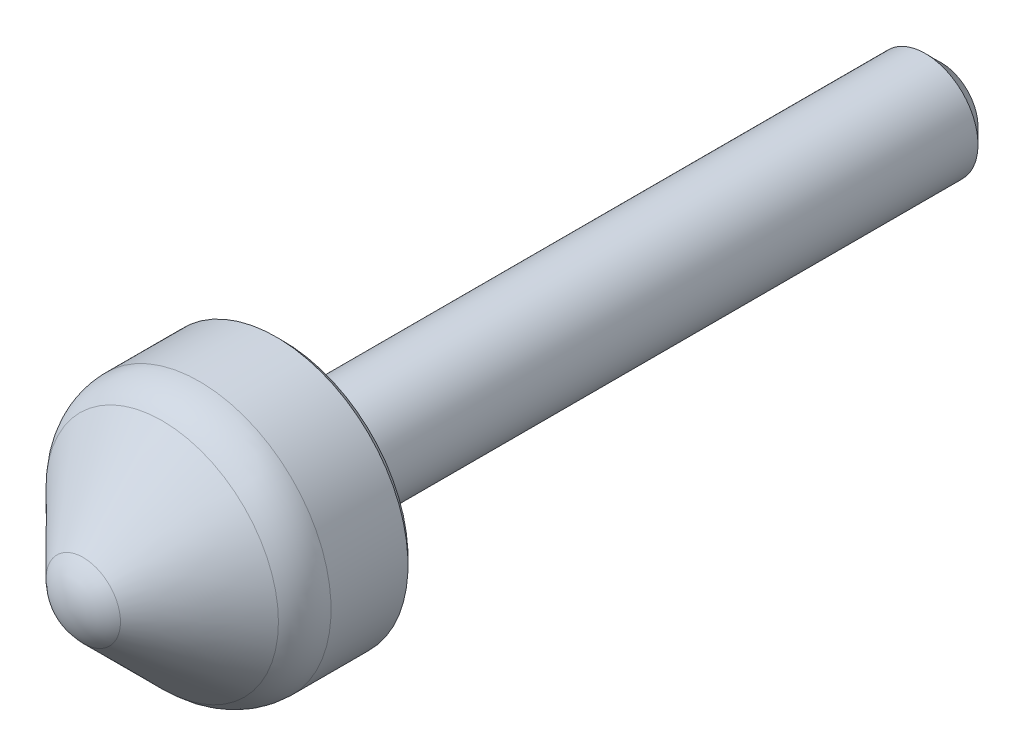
ISO-10303-21;
HEADER;
FILE_DESCRIPTION(('STEP AP214'),'2;1');
FILE_NAME('part.step','',(''),(''),'','','');
FILE_SCHEMA(('AUTOMOTIVE_DESIGN { 1 0 10303 214 1 1 1 1 }'));
ENDSEC;
DATA;
#1=APPLICATION_CONTEXT('core data for automotive mechanical design processes');
#2=APPLICATION_PROTOCOL_DEFINITION('international standard','automotive_design',2000,#1);
#3=PRODUCT_CONTEXT('',#1,'mechanical');
#4=PRODUCT('Part','Part','',(#3));
#5=PRODUCT_RELATED_PRODUCT_CATEGORY('part','',(#4));
#6=PRODUCT_DEFINITION_FORMATION('','',#4);
#7=PRODUCT_DEFINITION_CONTEXT('part definition',#1,'design');
#8=PRODUCT_DEFINITION('design','',#6,#7);
#9=PRODUCT_DEFINITION_SHAPE('','',#8);
#10=(LENGTH_UNIT() NAMED_UNIT(*) SI_UNIT(.MILLI.,.METRE.));
#11=(NAMED_UNIT(*) PLANE_ANGLE_UNIT() SI_UNIT($,.RADIAN.));
#12=(NAMED_UNIT(*) SI_UNIT($,.STERADIAN.) SOLID_ANGLE_UNIT());
#13=UNCERTAINTY_MEASURE_WITH_UNIT(LENGTH_MEASURE(1.E-05),#10,'distance_accuracy_value','');
#14=(GEOMETRIC_REPRESENTATION_CONTEXT(3) GLOBAL_UNCERTAINTY_ASSIGNED_CONTEXT((#13)) GLOBAL_UNIT_ASSIGNED_CONTEXT((#10,
#11,#12)) REPRESENTATION_CONTEXT('',''));
#15=CARTESIAN_POINT('',(0.,0.,0.));
#16=DIRECTION('',(0.,0.,1.));
#17=DIRECTION('',(1.,0.,0.));
#18=AXIS2_PLACEMENT_3D('',#15,#16,#17);
#19=CARTESIAN_POINT('',(0.,-2.8,-50.));
#20=DIRECTION('',(0.,0.,-1.));
#21=DIRECTION('',(1.,0.,0.));
#22=AXIS2_PLACEMENT_3D('',#19,#20,#21);
#23=PLANE('',#22);
#24=CARTESIAN_POINT('',(0.,0.,-50.));
#25=DIRECTION('',(0.,0.,1.));
#26=DIRECTION('',(-1.,0.,0.));
#27=AXIS2_PLACEMENT_3D('',#24,#25,#26);
#28=CIRCLE('',#27,2.8);
#29=CARTESIAN_POINT('',(-2.8,0.,-50.));
#30=VERTEX_POINT('',#29);
#31=EDGE_CURVE('E8',#30,#30,#28,.T.);
#32=ORIENTED_EDGE('',*,*,#31,.F.);
#33=EDGE_LOOP('',(#32));
#34=FACE_BOUND('',#33,.T.);
#35=ADVANCED_FACE('F12',(#34),#23,.T.);
#36=CARTESIAN_POINT('',(0.,0.,-48.8));
#37=DIRECTION('',(0.,0.,1.));
#38=DIRECTION('',(-1.,0.,0.));
#39=AXIS2_PLACEMENT_3D('',#36,#37,#38);
#40=CONICAL_SURFACE('',#39,4.,0.785398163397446);
#41=ORIENTED_EDGE('',*,*,#31,.T.);
#42=EDGE_LOOP('',(#41));
#43=FACE_BOUND('',#42,.T.);
#44=CARTESIAN_POINT('',(0.,0.,-48.8));
#45=DIRECTION('',(0.,0.,1.));
#46=DIRECTION('',(-1.,0.,0.));
#47=AXIS2_PLACEMENT_3D('',#44,#45,#46);
#48=CIRCLE('',#47,4.);
#49=CARTESIAN_POINT('',(-4.,0.,-48.8));
#50=VERTEX_POINT('',#49);
#51=EDGE_CURVE('E18',#50,#50,#48,.T.);
#52=ORIENTED_EDGE('',*,*,#51,.F.);
#53=EDGE_LOOP('',(#52));
#54=FACE_BOUND('',#53,.T.);
#55=ADVANCED_FACE('F65',(#43,#54),#40,.T.);
#56=CARTESIAN_POINT('',(0.,0.,18.));
#57=DIRECTION('',(0.,0.,1.));
#58=DIRECTION('',(-1.,0.,0.));
#59=AXIS2_PLACEMENT_3D('',#56,#57,#58);
#60=CYLINDRICAL_SURFACE('',#59,4.);
#61=ORIENTED_EDGE('',*,*,#51,.T.);
#62=EDGE_LOOP('',(#61));
#63=FACE_BOUND('',#62,.T.);
#64=CARTESIAN_POINT('',(0.,0.,-1.));
#65=DIRECTION('',(0.,0.,1.));
#66=DIRECTION('',(-1.,0.,0.));
#67=AXIS2_PLACEMENT_3D('',#64,#65,#66);
#68=CIRCLE('',#67,4.);
#69=CARTESIAN_POINT('',(-4.,0.,-1.));
#70=VERTEX_POINT('',#69);
#71=EDGE_CURVE('E22',#70,#70,#68,.T.);
#72=ORIENTED_EDGE('',*,*,#71,.F.);
#73=EDGE_LOOP('',(#72));
#74=FACE_BOUND('',#73,.T.);
#75=ADVANCED_FACE('F71',(#63,#74),#60,.T.);
#76=CARTESIAN_POINT('',(0.,0.,-1.));
#77=DIRECTION('',(0.,0.,1.));
#78=DIRECTION('',(-1.,0.,0.));
#79=AXIS2_PLACEMENT_3D('',#76,#77,#78);
#80=TOROIDAL_SURFACE('',#79,5.,1.);
#81=CARTESIAN_POINT('',(0.,0.,0.));
#82=DIRECTION('',(0.,0.,1.));
#83=DIRECTION('',(-1.,0.,0.));
#84=AXIS2_PLACEMENT_3D('',#81,#82,#83);
#85=CIRCLE('',#84,5.);
#86=CARTESIAN_POINT('',(-5.,0.,0.));
#87=VERTEX_POINT('',#86);
#88=EDGE_CURVE('E26',#87,#87,#85,.T.);
#89=ORIENTED_EDGE('',*,*,#88,.F.);
#90=EDGE_LOOP('',(#89));
#91=FACE_BOUND('',#90,.T.);
#92=ORIENTED_EDGE('',*,*,#71,.T.);
#93=EDGE_LOOP('',(#92));
#94=FACE_BOUND('',#93,.T.);
#95=ADVANCED_FACE('F76',(#91,#94),#80,.F.);
#96=CARTESIAN_POINT('',(0.,-9.5,0.));
#97=DIRECTION('',(0.,0.,-1.));
#98=DIRECTION('',(1.,0.,0.));
#99=AXIS2_PLACEMENT_3D('',#96,#97,#98);
#100=PLANE('',#99);
#101=ORIENTED_EDGE('',*,*,#88,.T.);
#102=EDGE_LOOP('',(#101));
#103=FACE_BOUND('',#102,.T.);
#104=CARTESIAN_POINT('',(0.,0.,0.));
#105=DIRECTION('',(0.,0.,1.));
#106=DIRECTION('',(-1.,0.,0.));
#107=AXIS2_PLACEMENT_3D('',#104,#105,#106);
#108=CIRCLE('',#107,9.5);
#109=CARTESIAN_POINT('',(-9.5,0.,0.));
#110=VERTEX_POINT('',#109);
#111=EDGE_CURVE('E31',#110,#110,#108,.T.);
#112=ORIENTED_EDGE('',*,*,#111,.F.);
#113=EDGE_LOOP('',(#112));
#114=FACE_BOUND('',#113,.T.);
#115=ADVANCED_FACE('F82',(#103,#114),#100,.T.);
#116=CARTESIAN_POINT('',(0.,0.,0.5));
#117=DIRECTION('',(0.,0.,1.));
#118=DIRECTION('',(-1.,0.,0.));
#119=AXIS2_PLACEMENT_3D('',#116,#117,#118);
#120=CONICAL_SURFACE('',#119,10.,0.785398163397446);
#121=ORIENTED_EDGE('',*,*,#111,.T.);
#122=EDGE_LOOP('',(#121));
#123=FACE_BOUND('',#122,.T.);
#124=CARTESIAN_POINT('',(0.,0.,0.5));
#125=DIRECTION('',(0.,0.,1.));
#126=DIRECTION('',(-1.,0.,0.));
#127=AXIS2_PLACEMENT_3D('',#124,#125,#126);
#128=CIRCLE('',#127,10.);
#129=CARTESIAN_POINT('',(-10.,0.,0.5));
#130=VERTEX_POINT('',#129);
#131=EDGE_CURVE('E34',#130,#130,#128,.T.);
#132=ORIENTED_EDGE('',*,*,#131,.F.);
#133=EDGE_LOOP('',(#132));
#134=FACE_BOUND('',#133,.T.);
#135=ADVANCED_FACE('F86',(#123,#134),#120,.T.);
#136=CARTESIAN_POINT('',(0.,0.,18.));
#137=DIRECTION('',(0.,0.,1.));
#138=DIRECTION('',(-1.,0.,0.));
#139=AXIS2_PLACEMENT_3D('',#136,#137,#138);
#140=CYLINDRICAL_SURFACE('',#139,10.);
#141=ORIENTED_EDGE('',*,*,#131,.T.);
#142=EDGE_LOOP('',(#141));
#143=FACE_BOUND('',#142,.T.);
#144=CARTESIAN_POINT('',(0.,0.,6.3431457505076));
#145=DIRECTION('',(0.,0.,1.));
#146=DIRECTION('',(-1.,0.,0.));
#147=AXIS2_PLACEMENT_3D('',#144,#145,#146);
#148=CIRCLE('',#147,10.);
#149=CARTESIAN_POINT('',(-10.,0.,6.3431457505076));
#150=VERTEX_POINT('',#149);
#151=EDGE_CURVE('E37',#150,#150,#148,.T.);
#152=ORIENTED_EDGE('',*,*,#151,.F.);
#153=EDGE_LOOP('',(#152));
#154=FACE_BOUND('',#153,.T.);
#155=ADVANCED_FACE('F61',(#143,#154),#140,.T.);
#156=CARTESIAN_POINT('',(0.,0.,6.3431457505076));
#157=DIRECTION('',(0.,0.,1.));
#158=DIRECTION('',(-1.,0.,0.));
#159=AXIS2_PLACEMENT_3D('',#156,#157,#158);
#160=TOROIDAL_SURFACE('',#159,6.,4.);
#161=CARTESIAN_POINT('',(0.,0.,9.17157287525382));
#162=DIRECTION('',(0.,0.,1.));
#163=DIRECTION('',(-1.,0.,0.));
#164=AXIS2_PLACEMENT_3D('',#161,#162,#163);
#165=CIRCLE('',#164,8.82842712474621);
#166=CARTESIAN_POINT('',(8.82842712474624,0.,9.17157287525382));
#167=VERTEX_POINT('',#166);
#168=EDGE_CURVE('E40',#167,#167,#165,.T.);
#169=ORIENTED_EDGE('',*,*,#168,.F.);
#170=EDGE_LOOP('',(#169));
#171=FACE_BOUND('',#170,.T.);
#172=ORIENTED_EDGE('',*,*,#151,.T.);
#173=EDGE_LOOP('',(#172));
#174=FACE_BOUND('',#173,.T.);
#175=ADVANCED_FACE('F51',(#171,#174),#160,.T.);
#176=CARTESIAN_POINT('',(0.,0.,15.1715728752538));
#177=DIRECTION('',(0.,0.,-1.));
#178=DIRECTION('',(1.,0.,0.));
#179=AXIS2_PLACEMENT_3D('',#176,#177,#178);
#180=CONICAL_SURFACE('',#179,2.82842712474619,0.78539816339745);
#181=CARTESIAN_POINT('',(0.,0.,15.1715728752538));
#182=DIRECTION('',(0.,0.,1.));
#183=DIRECTION('',(-1.,0.,0.));
#184=AXIS2_PLACEMENT_3D('',#181,#182,#183);
#185=CIRCLE('',#184,2.82842712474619);
#186=CARTESIAN_POINT('',(2.82842712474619,0.,15.1715728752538));
#187=VERTEX_POINT('',#186);
#188=EDGE_CURVE('E43',#187,#187,#185,.T.);
#189=CARTESIAN_POINT('',(8.82842712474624,0.,9.17157287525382));
#190=CARTESIAN_POINT('',(8.76592712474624,0.,9.23407287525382));
#191=CARTESIAN_POINT('',(8.70342712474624,0.,9.29657287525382));
#192=CARTESIAN_POINT('',(8.57842712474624,0.,9.42157287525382));
#193=CARTESIAN_POINT('',(8.51592712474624,0.,9.48407287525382));
#194=CARTESIAN_POINT('',(8.39092712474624,0.,9.60907287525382));
#195=CARTESIAN_POINT('',(8.32842712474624,0.,9.67157287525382));
#196=CARTESIAN_POINT('',(8.20342712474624,0.,9.79657287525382));
#197=CARTESIAN_POINT('',(8.14092712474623,0.,9.85907287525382));
#198=CARTESIAN_POINT('',(8.01592712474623,0.,9.98407287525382));
#199=CARTESIAN_POINT('',(7.95342712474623,0.,10.0465728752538));
#200=CARTESIAN_POINT('',(7.82842712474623,0.,10.1715728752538));
#201=CARTESIAN_POINT('',(7.76592712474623,0.,10.2340728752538));
#202=CARTESIAN_POINT('',(7.64092712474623,0.,10.3590728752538));
#203=CARTESIAN_POINT('',(7.57842712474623,0.,10.4215728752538));
#204=CARTESIAN_POINT('',(7.45342712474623,0.,10.5465728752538));
#205=CARTESIAN_POINT('',(7.39092712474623,0.,10.6090728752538));
#206=CARTESIAN_POINT('',(7.26592712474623,0.,10.7340728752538));
#207=CARTESIAN_POINT('',(7.20342712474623,0.,10.7965728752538));
#208=CARTESIAN_POINT('',(7.07842712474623,0.,10.9215728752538));
#209=CARTESIAN_POINT('',(7.01592712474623,0.,10.9840728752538));
#210=CARTESIAN_POINT('',(6.89092712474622,0.,11.1090728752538));
#211=CARTESIAN_POINT('',(6.82842712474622,0.,11.1715728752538));
#212=CARTESIAN_POINT('',(6.70342712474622,0.,11.2965728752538));
#213=CARTESIAN_POINT('',(6.64092712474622,0.,11.3590728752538));
#214=CARTESIAN_POINT('',(6.51592712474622,0.,11.4840728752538));
#215=CARTESIAN_POINT('',(6.45342712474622,0.,11.5465728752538));
#216=CARTESIAN_POINT('',(6.32842712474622,0.,11.6715728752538));
#217=CARTESIAN_POINT('',(6.26592712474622,0.,11.7340728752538));
#218=CARTESIAN_POINT('',(6.14092712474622,0.,11.8590728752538));
#219=CARTESIAN_POINT('',(6.07842712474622,0.,11.9215728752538));
#220=CARTESIAN_POINT('',(5.95342712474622,0.,12.0465728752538));
#221=CARTESIAN_POINT('',(5.89092712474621,0.,12.1090728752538));
#222=CARTESIAN_POINT('',(5.76592712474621,0.,12.2340728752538));
#223=CARTESIAN_POINT('',(5.70342712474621,0.,12.2965728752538));
#224=CARTESIAN_POINT('',(5.57842712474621,0.,12.4215728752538));
#225=CARTESIAN_POINT('',(5.51592712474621,0.,12.4840728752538));
#226=CARTESIAN_POINT('',(5.39092712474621,0.,12.6090728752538));
#227=CARTESIAN_POINT('',(5.32842712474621,0.,12.6715728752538));
#228=CARTESIAN_POINT('',(5.20342712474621,0.,12.7965728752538));
#229=CARTESIAN_POINT('',(5.14092712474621,0.,12.8590728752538));
#230=CARTESIAN_POINT('',(5.01592712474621,0.,12.9840728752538));
#231=CARTESIAN_POINT('',(4.95342712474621,0.,13.0465728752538));
#232=CARTESIAN_POINT('',(4.8284271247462,0.,13.1715728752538));
#233=CARTESIAN_POINT('',(4.7659271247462,0.,13.2340728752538));
#234=CARTESIAN_POINT('',(4.6409271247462,0.,13.3590728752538));
#235=CARTESIAN_POINT('',(4.5784271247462,0.,13.4215728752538));
#236=CARTESIAN_POINT('',(4.4534271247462,0.,13.5465728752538));
#237=CARTESIAN_POINT('',(4.3909271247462,0.,13.6090728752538));
#238=CARTESIAN_POINT('',(4.2659271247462,0.,13.7340728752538));
#239=CARTESIAN_POINT('',(4.2034271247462,0.,13.7965728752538));
#240=CARTESIAN_POINT('',(4.0784271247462,0.,13.9215728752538));
#241=CARTESIAN_POINT('',(4.0159271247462,0.,13.9840728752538));
#242=CARTESIAN_POINT('',(3.8909271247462,0.,14.1090728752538));
#243=CARTESIAN_POINT('',(3.8284271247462,0.,14.1715728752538));
#244=CARTESIAN_POINT('',(3.70342712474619,0.,14.2965728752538));
#245=CARTESIAN_POINT('',(3.64092712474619,0.,14.3590728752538));
#246=CARTESIAN_POINT('',(3.51592712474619,0.,14.4840728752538));
#247=CARTESIAN_POINT('',(3.45342712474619,0.,14.5465728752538));
#248=CARTESIAN_POINT('',(3.32842712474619,0.,14.6715728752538));
#249=CARTESIAN_POINT('',(3.26592712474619,0.,14.7340728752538));
#250=CARTESIAN_POINT('',(3.14092712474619,0.,14.8590728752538));
#251=CARTESIAN_POINT('',(3.07842712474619,0.,14.9215728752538));
#252=CARTESIAN_POINT('',(2.95342712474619,0.,15.0465728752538));
#253=CARTESIAN_POINT('',(2.89092712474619,0.,15.1090728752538));
#254=CARTESIAN_POINT('',(2.82842712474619,0.,15.1715728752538));
#255=B_SPLINE_CURVE_WITH_KNOTS('',3,(#189,#190,#191,#192,#193,#194,#195,#196,#197,#198,#199,
#200,#201,#202,#203,#204,#205,#206,#207,#208,#209,#210,#211,#212,#213,#214,#215,#216,#217,#218,
#219,#220,#221,#222,#223,#224,#225,#226,#227,#228,#229,#230,#231,#232,#233,#234,#235,#236,#237,
#238,#239,#240,#241,#242,#243,#244,#245,#246,#247,#248,#249,#250,#251,#252,#253,#254),
.UNSPECIFIED.,.F.,.F.,(4,2,2,2,2,2,2,2,2,2,2,2,2,2,2,2,2,2,2,2,2,2,2,2,2,2,2,2,2,2,2,2,4),(0.,
0.265165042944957,0.530330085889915,0.79549512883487,1.06066017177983,1.32582521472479,
1.59099025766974,1.8561553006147,2.12132034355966,2.38648538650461,2.65165042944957,
2.91681547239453,3.18198051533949,3.44714555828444,3.7123106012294,3.97747564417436,
4.24264068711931,4.50780573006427,4.77297077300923,5.03813581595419,5.30330085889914,
5.5684659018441,5.83363094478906,6.09879598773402,6.36396103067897,6.62912607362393,
6.89429111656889,7.15945615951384,7.4246212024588,7.68978624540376,7.95495128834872,
8.22011633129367,8.48528137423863),.UNSPECIFIED.);
#256=EDGE_CURVE('BSEAM49',#167,#187,#255,.T.);
#257=ORIENTED_EDGE('',*,*,#168,.T.);
#258=ORIENTED_EDGE('',*,*,#188,.F.);
#259=ORIENTED_EDGE('',*,*,#256,.T.);
#260=ORIENTED_EDGE('',*,*,#256,.F.);
#261=EDGE_LOOP('',(#257,#259,#258,#260));
#262=FACE_BOUND('',#261,.T.);
#263=ADVANCED_FACE('F49',(#262),#180,.T.);
#264=CARTESIAN_POINT('',(0.,0.,12.3431457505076));
#265=DIRECTION('',(-1.,0.,0.));
#266=DIRECTION('',(0.,0.,-1.));
#267=AXIS2_PLACEMENT_3D('',#264,#265,#266);
#268=SPHERICAL_SURFACE('',#267,4.);
#269=CARTESIAN_POINT('',(0.,0.,12.3431457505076));
#270=DIRECTION('',(0.,0.,1.));
#271=DIRECTION('',(-1.,0.,0.));
#272=AXIS2_PLACEMENT_3D('',#269,#270,#271);
#273=SPHERICAL_SURFACE('',#272,4.);
#274=ORIENTED_EDGE('',*,*,#188,.T.);
#275=EDGE_LOOP('',(#274));
#276=FACE_BOUND('',#275,.T.);
#277=ADVANCED_FACE('F47',(#276),#273,.T.);
#278=CLOSED_SHELL('',(#35,#55,#75,#95,#115,#135,#155,#175,#263,#277));
#279=MANIFOLD_SOLID_BREP('B1',#278);
#280=ADVANCED_BREP_SHAPE_REPRESENTATION('',(#18,#279),#14);
#281=SHAPE_DEFINITION_REPRESENTATION(#9,#280);
ENDSEC;
END-ISO-10303-21;
